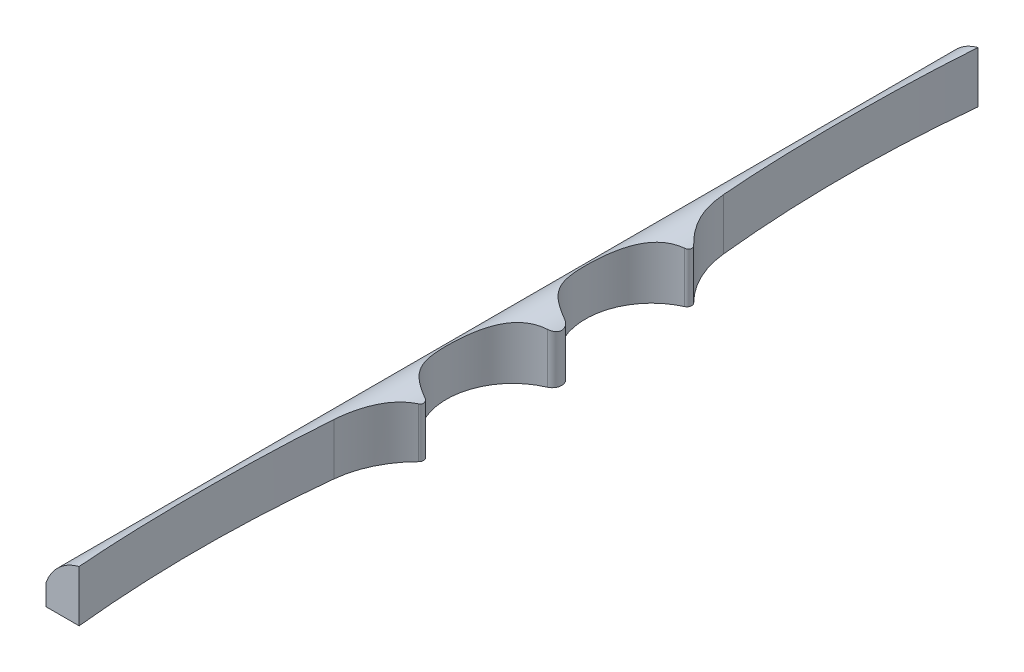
from build123d import *

# Parameters (mm, degrees)
CROQUIS1_W              = 80
CROQUIS1_H              = 70
EXTRUIR1_DEPTH          = 490
CROQUIS2_W              = 80
CROQUIS2_H              = 15
CORTE_LARGO_DEPTH       = 497.588360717
PERFILADO_FRONTAL_DEPTH = 482.79352424
PERFILADO_LATERAL_DEPTH = 952.485680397


with BuildPart() as part:
    # Croquis1 → Extruir1 (new, symmetric)
    with BuildSketch(Plane.XY):
        Rectangle(CROQUIS1_W, CROQUIS1_H)
    extrude(amount=EXTRUIR1_DEPTH, both=True)

    # Croquis2 → Corte - largo (cut, through all)
    with BuildSketch(Plane(origin=(0, 35, 0), x_dir=(1, 0, 0), z_dir=(0, 1, 0))):
        with Locations((0, 482.5)):
            Rectangle(CROQUIS2_W, CROQUIS2_H)
        with Locations((0, -482.5)):
            Rectangle(CROQUIS2_W, CROQUIS2_H)
    extrude(amount=-CORTE_LARGO_DEPTH, mode=Mode.SUBTRACT)

    # Croquis3 → Perfilado frontal (cut, through all)
    with BuildSketch(Plane(origin=(0, 35, 0), x_dir=(1, 0, 0), z_dir=(0, 1, 0))):
        with BuildLine():
            Line((-5, 475), (40, 475))
            Line((40, 475), (40, -475))
            Line((40, -475), (-5, -475))
            ThreePointArc((-5, -475), (-11.889827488, -340.46150496), (-4.843152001, -205.931133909))
            ThreePointArc((-4.843152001, -205.931133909), (4.439947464, -173.096218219), (24.222277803, -145.293933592))
            ThreePointArc((24.222277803, -145.293933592), (25.624140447, -140.860276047), (22.769361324, -137.189748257))
            ThreePointArc((22.769361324, -137.189748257), (-18.293035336, -72.797025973), (23.962990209, -9.181214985))
            ThreePointArc((23.962990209, -9.181214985), (30, 0), (23.962990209, 9.181214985))
            ThreePointArc((23.962990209, 9.181214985), (-18.293035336, 72.797025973), (22.769361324, 137.189748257))
            ThreePointArc((22.769361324, 137.189748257), (25.624140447, 140.860276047), (24.222277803, 145.293933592))
            ThreePointArc((24.222277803, 145.293933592), (4.439947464, 173.096218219), (-4.843152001, 205.931133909))
            ThreePointArc((-4.843152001, 205.931133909), (-11.889827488, 340.46150496), (-5, 475))
        make_face()
    extrude(amount=-PERFILADO_FRONTAL_DEPTH, mode=Mode.SUBTRACT)

    # Croquis4 → Perfilado lateral (cut, through all)
    with BuildSketch(Plane(origin=(0, 0, -475), x_dir=(-1, 0, 0), z_dir=(0, 0, -1))):
        with BuildLine():
            Line((40, -13), (40, 35))
            Line((40, 35), (-30, 35))
            Line((-30, 35), (-30, 15.488310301))
            ThreePointArc((-30, 15.488310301), (11.505096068, 17.228140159), (40, -13))
        make_face()
    extrude(amount=-PERFILADO_LATERAL_DEPTH, mode=Mode.SUBTRACT)


solid = part.part
